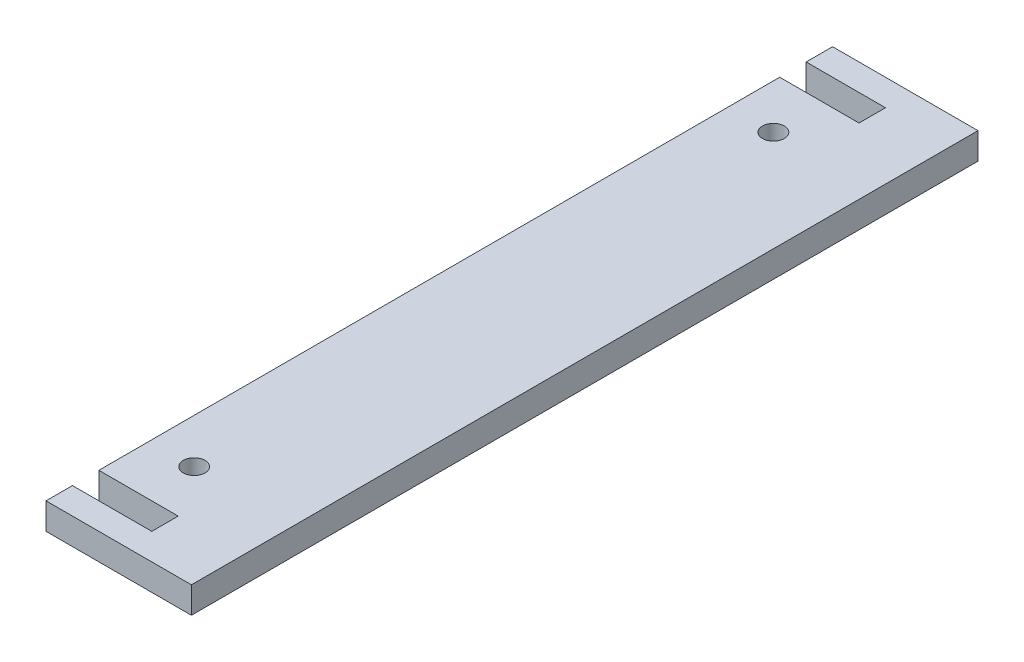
from build123d import *

# Parameters (mm, degrees)
SKETCH1_R      = 1.65
EXTRUDE1_DEPTH = 4


with BuildPart() as part:
    # Sketch1 → Extrude1 (new body)
    with BuildSketch(Plane(origin=(0, 0, 0), x_dir=(1, 0, 0), z_dir=(0, 1, 0))):
        Polygon((-11, 55.5), (-11, 59.5), (11, 59.5), (11, -59.5), (-11, -59.5), (-11, -55.5), (1, -55.5), (1, -51.5), (-11, -51.5), (-11, 51.5), (1, 51.5), (1, 55.5), align=None)
        with Locations(Location((-4.27, 43.815, 0), (0, 0, 270))):
            Circle(SKETCH1_R, mode=Mode.SUBTRACT)
        with Locations(Location((-4.27, -43.815, 0), (0, 0, 270))):
            Circle(SKETCH1_R, mode=Mode.SUBTRACT)
    extrude(amount=EXTRUDE1_DEPTH)


solid = part.part
